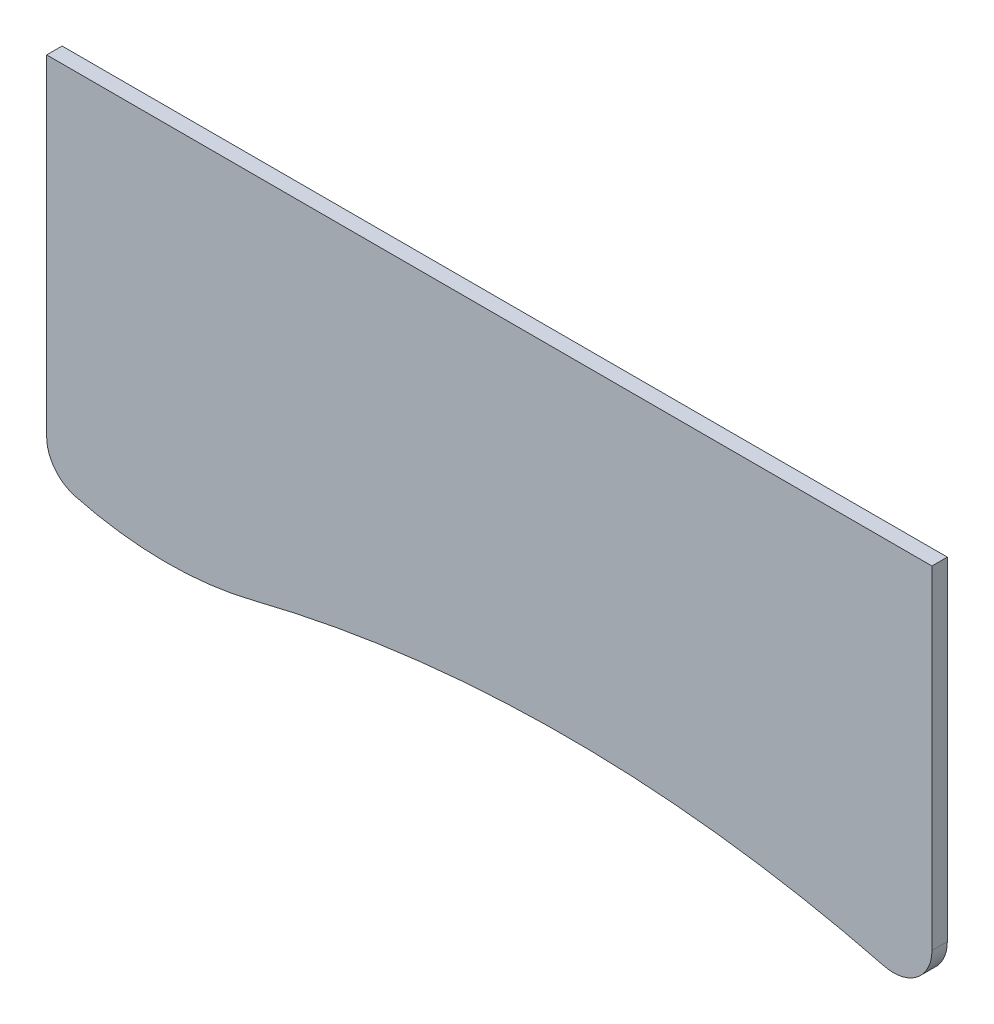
ISO-10303-21;
HEADER;
FILE_DESCRIPTION(('STEP AP214'),'2;1');
FILE_NAME('part.step','',(''),(''),'','','');
FILE_SCHEMA(('AUTOMOTIVE_DESIGN { 1 0 10303 214 1 1 1 1 }'));
ENDSEC;
DATA;
#1=APPLICATION_CONTEXT('core data for automotive mechanical design processes');
#2=APPLICATION_PROTOCOL_DEFINITION('international standard','automotive_design',2000,#1);
#3=PRODUCT_CONTEXT('',#1,'mechanical');
#4=PRODUCT('Part','Part','',(#3));
#5=PRODUCT_RELATED_PRODUCT_CATEGORY('part','',(#4));
#6=PRODUCT_DEFINITION_FORMATION('','',#4);
#7=PRODUCT_DEFINITION_CONTEXT('part definition',#1,'design');
#8=PRODUCT_DEFINITION('design','',#6,#7);
#9=PRODUCT_DEFINITION_SHAPE('','',#8);
#10=(LENGTH_UNIT() NAMED_UNIT(*) SI_UNIT(.MILLI.,.METRE.));
#11=(NAMED_UNIT(*) PLANE_ANGLE_UNIT() SI_UNIT($,.RADIAN.));
#12=(NAMED_UNIT(*) SI_UNIT($,.STERADIAN.) SOLID_ANGLE_UNIT());
#13=UNCERTAINTY_MEASURE_WITH_UNIT(LENGTH_MEASURE(1.E-05),#10,'distance_accuracy_value','');
#14=(GEOMETRIC_REPRESENTATION_CONTEXT(3) GLOBAL_UNCERTAINTY_ASSIGNED_CONTEXT((#13)) GLOBAL_UNIT_ASSIGNED_CONTEXT((#10,
#11,#12)) REPRESENTATION_CONTEXT('',''));
#15=CARTESIAN_POINT('',(0.,0.,0.));
#16=DIRECTION('',(0.,0.,1.));
#17=DIRECTION('',(1.,0.,0.));
#18=AXIS2_PLACEMENT_3D('',#15,#16,#17);
#19=CARTESIAN_POINT('',(0.,0.,-12.));
#20=DIRECTION('',(0.,0.,-1.));
#21=DIRECTION('',(-1.,0.,0.));
#22=AXIS2_PLACEMENT_3D('',#19,#20,#21);
#23=PLANE('',#22);
#24=CARTESIAN_POINT('',(93.3184278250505,282.430796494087,-12.));
#25=DIRECTION('',(0.,0.,-1.));
#26=DIRECTION('',(-1.,0.,0.));
#27=AXIS2_PLACEMENT_3D('',#24,#25,#26);
#28=CIRCLE('',#27,278.494010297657);
#29=CARTESIAN_POINT('',(161.20380964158,12.3373150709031,-12.));
#30=VERTEX_POINT('',#29);
#31=CARTESIAN_POINT('',(22.3557399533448,13.1294583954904,-12.));
#32=VERTEX_POINT('',#31);
#33=EDGE_CURVE('E107',#30,#32,#28,.T.);
#34=ORIENTED_EDGE('',*,*,#33,.T.);
#35=CARTESIAN_POINT('',(30.,42.139203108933,-12.));
#36=DIRECTION('',(0.,0.,-1.));
#37=DIRECTION('',(-1.,0.,0.));
#38=AXIS2_PLACEMENT_3D('',#35,#36,#37);
#39=CIRCLE('',#38,30.);
#40=CARTESIAN_POINT('',(0.,42.139203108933,-12.));
#41=VERTEX_POINT('',#40);
#42=EDGE_CURVE('E12',#32,#41,#39,.T.);
#43=ORIENTED_EDGE('',*,*,#42,.T.);
#44=DIRECTION('',(0.,-1.,0.));
#45=VECTOR('',#44,1.);
#46=CARTESIAN_POINT('',(0.,0.,-12.));
#47=LINE('',#46,#45);
#48=CARTESIAN_POINT('',(0.,300.,-12.));
#49=VERTEX_POINT('',#48);
#50=EDGE_CURVE('E306',#49,#41,#47,.T.);
#51=ORIENTED_EDGE('',*,*,#50,.F.);
#52=DIRECTION('',(-1.,0.,0.));
#53=VECTOR('',#52,1.);
#54=CARTESIAN_POINT('',(0.,300.,-12.));
#55=LINE('',#54,#53);
#56=CARTESIAN_POINT('',(690.,300.,-12.));
#57=VERTEX_POINT('',#56);
#58=EDGE_CURVE('E278',#57,#49,#55,.T.);
#59=ORIENTED_EDGE('',*,*,#58,.F.);
#60=DIRECTION('',(0.,1.,0.));
#61=VECTOR('',#60,1.);
#62=CARTESIAN_POINT('',(690.,0.,-12.));
#63=LINE('',#62,#61);
#64=CARTESIAN_POINT('',(690.,40.4272710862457,-12.));
#65=VERTEX_POINT('',#64);
#66=EDGE_CURVE('E283',#65,#57,#63,.T.);
#67=ORIENTED_EDGE('',*,*,#66,.F.);
#68=CARTESIAN_POINT('',(660.,40.4272710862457,-12.));
#69=DIRECTION('',(0.,0.,-1.));
#70=DIRECTION('',(-1.,0.,0.));
#71=AXIS2_PLACEMENT_3D('',#68,#69,#70);
#72=CIRCLE('',#71,30.);
#73=CARTESIAN_POINT('',(652.57172817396,11.3614702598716,-12.));
#74=VERTEX_POINT('',#73);
#75=EDGE_CURVE('E111',#65,#74,#72,.T.);
#76=ORIENTED_EDGE('',*,*,#75,.T.);
#77=CARTESIAN_POINT('',(404.962667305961,-957.498557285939,-12.));
#78=DIRECTION('',(0.,0.,1.));
#79=DIRECTION('',(1.,0.,0.));
#80=AXIS2_PLACEMENT_3D('',#77,#78,#79);
#81=CIRCLE('',#80,1000.);
#82=EDGE_CURVE('E105',#74,#30,#81,.T.);
#83=ORIENTED_EDGE('',*,*,#82,.T.);
#84=EDGE_LOOP('',(#34,#43,#51,#59,#67,#76,#83));
#85=FACE_BOUND('',#84,.T.);
#86=ADVANCED_FACE('F45',(#85),#23,.T.);
#87=CARTESIAN_POINT('',(0.,0.,0.));
#88=DIRECTION('',(0.,0.,-1.));
#89=DIRECTION('',(-1.,0.,0.));
#90=AXIS2_PLACEMENT_3D('',#87,#88,#89);
#91=PLANE('',#90);
#92=DIRECTION('',(0.,-1.,0.));
#93=VECTOR('',#92,1.);
#94=CARTESIAN_POINT('',(0.,0.,0.));
#95=LINE('',#94,#93);
#96=CARTESIAN_POINT('',(0.,300.,0.));
#97=VERTEX_POINT('',#96);
#98=CARTESIAN_POINT('',(0.,42.139203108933,0.));
#99=VERTEX_POINT('',#98);
#100=EDGE_CURVE('E124',#97,#99,#95,.T.);
#101=ORIENTED_EDGE('',*,*,#100,.T.);
#102=CARTESIAN_POINT('',(30.,42.139203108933,0.));
#103=DIRECTION('',(0.,0.,-1.));
#104=DIRECTION('',(-1.,0.,0.));
#105=AXIS2_PLACEMENT_3D('',#102,#103,#104);
#106=CIRCLE('',#105,30.);
#107=CARTESIAN_POINT('',(22.3557399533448,13.1294583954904,0.));
#108=VERTEX_POINT('',#107);
#109=EDGE_CURVE('E69',#99,#108,#106,.F.);
#110=ORIENTED_EDGE('',*,*,#109,.T.);
#111=CARTESIAN_POINT('',(93.3184278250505,282.430796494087,0.));
#112=DIRECTION('',(0.,0.,-1.));
#113=DIRECTION('',(-1.,0.,0.));
#114=AXIS2_PLACEMENT_3D('',#111,#112,#113);
#115=CIRCLE('',#114,278.494010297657);
#116=CARTESIAN_POINT('',(161.20380964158,12.3373150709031,0.));
#117=VERTEX_POINT('',#116);
#118=EDGE_CURVE('E116',#117,#108,#115,.T.);
#119=ORIENTED_EDGE('',*,*,#118,.F.);
#120=CARTESIAN_POINT('',(404.962667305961,-957.498557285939,0.));
#121=DIRECTION('',(0.,0.,-1.));
#122=DIRECTION('',(-1.,0.,0.));
#123=AXIS2_PLACEMENT_3D('',#120,#121,#122);
#124=CIRCLE('',#123,1000.);
#125=CARTESIAN_POINT('',(652.57172817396,11.3614702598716,0.));
#126=VERTEX_POINT('',#125);
#127=EDGE_CURVE('E122',#117,#126,#124,.T.);
#128=ORIENTED_EDGE('',*,*,#127,.T.);
#129=CARTESIAN_POINT('',(660.,40.4272710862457,0.));
#130=DIRECTION('',(0.,0.,-1.));
#131=DIRECTION('',(-1.,0.,0.));
#132=AXIS2_PLACEMENT_3D('',#129,#130,#131);
#133=CIRCLE('',#132,30.);
#134=CARTESIAN_POINT('',(690.,40.4272710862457,0.));
#135=VERTEX_POINT('',#134);
#136=EDGE_CURVE('E221',#126,#135,#133,.F.);
#137=ORIENTED_EDGE('',*,*,#136,.T.);
#138=DIRECTION('',(0.,1.,0.));
#139=VECTOR('',#138,1.);
#140=CARTESIAN_POINT('',(690.,0.,0.));
#141=LINE('',#140,#139);
#142=CARTESIAN_POINT('',(690.,300.,0.));
#143=VERTEX_POINT('',#142);
#144=EDGE_CURVE('E328',#135,#143,#141,.T.);
#145=ORIENTED_EDGE('',*,*,#144,.T.);
#146=DIRECTION('',(-1.,0.,0.));
#147=VECTOR('',#146,1.);
#148=CARTESIAN_POINT('',(0.,300.,0.));
#149=LINE('',#148,#147);
#150=EDGE_CURVE('E253',#143,#97,#149,.T.);
#151=ORIENTED_EDGE('',*,*,#150,.T.);
#152=EDGE_LOOP('',(#101,#110,#119,#128,#137,#145,#151));
#153=FACE_BOUND('',#152,.T.);
#154=ADVANCED_FACE('F359',(#153),#91,.F.);
#155=CARTESIAN_POINT('',(0.,0.,-12.));
#156=DIRECTION('',(-1.,0.,0.));
#157=DIRECTION('',(0.,0.,1.));
#158=AXIS2_PLACEMENT_3D('',#155,#156,#157);
#159=PLANE('',#158);
#160=ORIENTED_EDGE('',*,*,#50,.T.);
#161=DIRECTION('',(0.,0.,-1.));
#162=VECTOR('',#161,1.);
#163=CARTESIAN_POINT('',(0.,42.139203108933,0.));
#164=LINE('',#163,#162);
#165=EDGE_CURVE('E176',#41,#99,#164,.F.);
#166=ORIENTED_EDGE('',*,*,#165,.T.);
#167=ORIENTED_EDGE('',*,*,#100,.F.);
#168=DIRECTION('',(0.,0.,1.));
#169=VECTOR('',#168,1.);
#170=CARTESIAN_POINT('',(0.,300.,-12.));
#171=LINE('',#170,#169);
#172=EDGE_CURVE('E248',#49,#97,#171,.T.);
#173=ORIENTED_EDGE('',*,*,#172,.F.);
#174=EDGE_LOOP('',(#160,#166,#167,#173));
#175=FACE_BOUND('',#174,.T.);
#176=ADVANCED_FACE('F363',(#175),#159,.T.);
#177=CARTESIAN_POINT('',(0.,300.,-12.));
#178=DIRECTION('',(0.,1.,0.));
#179=DIRECTION('',(0.,0.,1.));
#180=AXIS2_PLACEMENT_3D('',#177,#178,#179);
#181=PLANE('',#180);
#182=ORIENTED_EDGE('',*,*,#150,.F.);
#183=DIRECTION('',(0.,0.,1.));
#184=VECTOR('',#183,1.);
#185=CARTESIAN_POINT('',(690.,300.,-12.));
#186=LINE('',#185,#184);
#187=EDGE_CURVE('E252',#57,#143,#186,.T.);
#188=ORIENTED_EDGE('',*,*,#187,.F.);
#189=ORIENTED_EDGE('',*,*,#58,.T.);
#190=ORIENTED_EDGE('',*,*,#172,.T.);
#191=EDGE_LOOP('',(#182,#188,#189,#190));
#192=FACE_BOUND('',#191,.T.);
#193=ADVANCED_FACE('F381',(#192),#181,.T.);
#194=CARTESIAN_POINT('',(690.,0.,-12.));
#195=DIRECTION('',(1.,0.,0.));
#196=DIRECTION('',(0.,0.,-1.));
#197=AXIS2_PLACEMENT_3D('',#194,#195,#196);
#198=PLANE('',#197);
#199=ORIENTED_EDGE('',*,*,#144,.F.);
#200=DIRECTION('',(0.,0.,-1.));
#201=VECTOR('',#200,1.);
#202=CARTESIAN_POINT('',(690.,40.4272710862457,-12.));
#203=LINE('',#202,#201);
#204=EDGE_CURVE('E177',#135,#65,#203,.T.);
#205=ORIENTED_EDGE('',*,*,#204,.T.);
#206=ORIENTED_EDGE('',*,*,#66,.T.);
#207=ORIENTED_EDGE('',*,*,#187,.T.);
#208=EDGE_LOOP('',(#199,#205,#206,#207));
#209=FACE_BOUND('',#208,.T.);
#210=ADVANCED_FACE('F377',(#209),#198,.T.);
#211=CARTESIAN_POINT('',(404.962667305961,-957.498557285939,-12.));
#212=DIRECTION('',(0.,0.,1.));
#213=DIRECTION('',(1.,0.,0.));
#214=AXIS2_PLACEMENT_3D('',#211,#212,#213);
#215=CYLINDRICAL_SURFACE('',#214,1000.);
#216=ORIENTED_EDGE('',*,*,#82,.F.);
#217=DIRECTION('',(0.,0.,1.));
#218=VECTOR('',#217,1.);
#219=CARTESIAN_POINT('',(652.57172817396,11.3614702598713,-12.));
#220=LINE('',#219,#218);
#221=EDGE_CURVE('E218',#74,#126,#220,.T.);
#222=ORIENTED_EDGE('',*,*,#221,.T.);
#223=ORIENTED_EDGE('',*,*,#127,.F.);
#224=DIRECTION('',(0.,0.,1.));
#225=VECTOR('',#224,1.);
#226=CARTESIAN_POINT('',(161.20380964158,12.3373150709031,-12.));
#227=LINE('',#226,#225);
#228=EDGE_CURVE('E119',#30,#117,#227,.T.);
#229=ORIENTED_EDGE('',*,*,#228,.F.);
#230=EDGE_LOOP('',(#216,#222,#223,#229));
#231=FACE_BOUND('',#230,.T.);
#232=ADVANCED_FACE('F120',(#231),#215,.F.);
#233=CARTESIAN_POINT('',(93.3184278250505,282.430796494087,-12.));
#234=DIRECTION('',(0.,0.,1.));
#235=DIRECTION('',(1.,0.,0.));
#236=AXIS2_PLACEMENT_3D('',#233,#234,#235);
#237=CYLINDRICAL_SURFACE('',#236,278.494010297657);
#238=ORIENTED_EDGE('',*,*,#118,.T.);
#239=DIRECTION('',(0.,0.,1.));
#240=VECTOR('',#239,1.);
#241=CARTESIAN_POINT('',(22.3557399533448,13.1294583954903,-12.));
#242=LINE('',#241,#240);
#243=EDGE_CURVE('E55',#108,#32,#242,.F.);
#244=ORIENTED_EDGE('',*,*,#243,.T.);
#245=ORIENTED_EDGE('',*,*,#33,.F.);
#246=ORIENTED_EDGE('',*,*,#228,.T.);
#247=EDGE_LOOP('',(#238,#244,#245,#246));
#248=FACE_BOUND('',#247,.T.);
#249=ADVANCED_FACE('F126',(#248),#237,.T.);
#250=CARTESIAN_POINT('',(660.,40.4272710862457,-12.));
#251=DIRECTION('',(0.,0.,1.));
#252=DIRECTION('',(1.,0.,0.));
#253=AXIS2_PLACEMENT_3D('',#250,#251,#252);
#254=CYLINDRICAL_SURFACE('',#253,30.);
#255=ORIENTED_EDGE('',*,*,#75,.F.);
#256=ORIENTED_EDGE('',*,*,#204,.F.);
#257=ORIENTED_EDGE('',*,*,#136,.F.);
#258=ORIENTED_EDGE('',*,*,#221,.F.);
#259=EDGE_LOOP('',(#255,#256,#257,#258));
#260=FACE_BOUND('',#259,.T.);
#261=ADVANCED_FACE('F383',(#260),#254,.T.);
#262=CARTESIAN_POINT('',(30.,42.139203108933,-12.));
#263=DIRECTION('',(0.,0.,1.));
#264=DIRECTION('',(1.,0.,0.));
#265=AXIS2_PLACEMENT_3D('',#262,#263,#264);
#266=CYLINDRICAL_SURFACE('',#265,30.);
#267=ORIENTED_EDGE('',*,*,#42,.F.);
#268=ORIENTED_EDGE('',*,*,#243,.F.);
#269=ORIENTED_EDGE('',*,*,#109,.F.);
#270=ORIENTED_EDGE('',*,*,#165,.F.);
#271=EDGE_LOOP('',(#267,#268,#269,#270));
#272=FACE_BOUND('',#271,.T.);
#273=ADVANCED_FACE('F47',(#272),#266,.T.);
#274=CLOSED_SHELL('',(#86,#154,#176,#193,#210,#232,#249,#261,#273));
#275=MANIFOLD_SOLID_BREP('B2',#274);
#276=ADVANCED_BREP_SHAPE_REPRESENTATION('',(#18,#275),#14);
#277=SHAPE_DEFINITION_REPRESENTATION(#9,#276);
ENDSEC;
END-ISO-10303-21;
